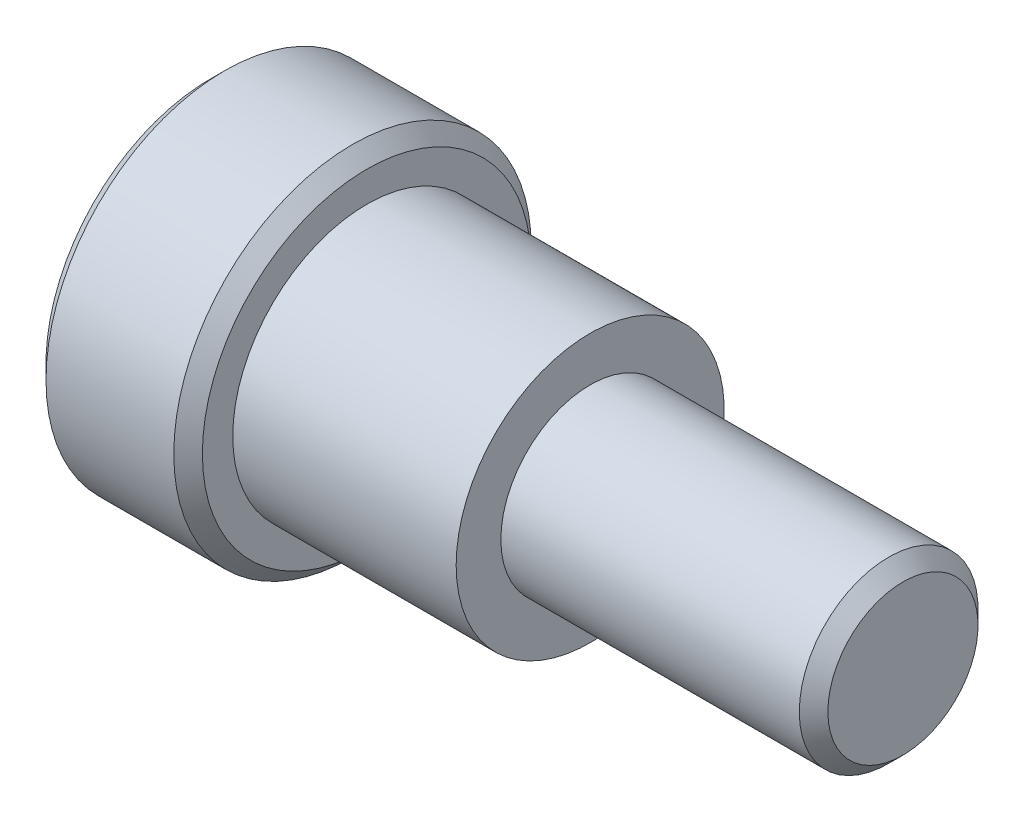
ISO-10303-21;
HEADER;
FILE_DESCRIPTION(('STEP AP214'),'2;1');
FILE_NAME('part.step','',(''),(''),'','','');
FILE_SCHEMA(('AUTOMOTIVE_DESIGN { 1 0 10303 214 1 1 1 1 }'));
ENDSEC;
DATA;
#1=APPLICATION_CONTEXT('core data for automotive mechanical design processes');
#2=APPLICATION_PROTOCOL_DEFINITION('international standard','automotive_design',2000,#1);
#3=PRODUCT_CONTEXT('',#1,'mechanical');
#4=PRODUCT('Part','Part','',(#3));
#5=PRODUCT_RELATED_PRODUCT_CATEGORY('part','',(#4));
#6=PRODUCT_DEFINITION_FORMATION('','',#4);
#7=PRODUCT_DEFINITION_CONTEXT('part definition',#1,'design');
#8=PRODUCT_DEFINITION('design','',#6,#7);
#9=PRODUCT_DEFINITION_SHAPE('','',#8);
#10=(LENGTH_UNIT() NAMED_UNIT(*) SI_UNIT(.MILLI.,.METRE.));
#11=(NAMED_UNIT(*) PLANE_ANGLE_UNIT() SI_UNIT($,.RADIAN.));
#12=(NAMED_UNIT(*) SI_UNIT($,.STERADIAN.) SOLID_ANGLE_UNIT());
#13=UNCERTAINTY_MEASURE_WITH_UNIT(LENGTH_MEASURE(1.E-05),#10,'distance_accuracy_value','');
#14=(GEOMETRIC_REPRESENTATION_CONTEXT(3) GLOBAL_UNCERTAINTY_ASSIGNED_CONTEXT((#13)) GLOBAL_UNIT_ASSIGNED_CONTEXT((#10,
#11,#12)) REPRESENTATION_CONTEXT('',''));
#15=CARTESIAN_POINT('',(0.,0.,0.));
#16=DIRECTION('',(0.,0.,1.));
#17=DIRECTION('',(1.,0.,0.));
#18=AXIS2_PLACEMENT_3D('',#15,#16,#17);
#19=CARTESIAN_POINT('',(0.,6.35,0.));
#20=DIRECTION('',(1.,0.,0.));
#21=DIRECTION('',(0.,0.,-1.));
#22=AXIS2_PLACEMENT_3D('',#19,#20,#21);
#23=PLANE('',#22);
#24=DIRECTION('',(0.,-0.866025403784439,0.499999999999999));
#25=VECTOR('',#24,1.);
#26=CARTESIAN_POINT('',(0.,-1.984375,-1.14567944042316));
#27=LINE('',#26,#25);
#28=CARTESIAN_POINT('',(0.,0.,-2.29135888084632));
#29=VERTEX_POINT('',#28);
#30=CARTESIAN_POINT('',(0.,-1.984375,-1.14567944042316));
#31=VERTEX_POINT('',#30);
#32=EDGE_CURVE('E124',#29,#31,#27,.T.);
#33=ORIENTED_EDGE('',*,*,#32,.F.);
#34=DIRECTION('',(0.,-0.86602540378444,-0.499999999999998));
#35=VECTOR('',#34,1.);
#36=CARTESIAN_POINT('',(0.,0.,-2.29135888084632));
#37=LINE('',#36,#35);
#38=CARTESIAN_POINT('',(0.,1.984375,-1.14567944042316));
#39=VERTEX_POINT('',#38);
#40=EDGE_CURVE('E50',#39,#29,#37,.T.);
#41=ORIENTED_EDGE('',*,*,#40,.F.);
#42=DIRECTION('',(0.,0.,-1.));
#43=VECTOR('',#42,1.);
#44=CARTESIAN_POINT('',(0.,1.984375,-1.14567944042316));
#45=LINE('',#44,#43);
#46=CARTESIAN_POINT('',(0.,1.984375,1.14567944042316));
#47=VERTEX_POINT('',#46);
#48=EDGE_CURVE('E133',#47,#39,#45,.T.);
#49=ORIENTED_EDGE('',*,*,#48,.F.);
#50=DIRECTION('',(0.,0.866025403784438,-0.500000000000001));
#51=VECTOR('',#50,1.);
#52=CARTESIAN_POINT('',(0.,1.984375,1.14567944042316));
#53=LINE('',#52,#51);
#54=CARTESIAN_POINT('',(0.,0.,2.29135888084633));
#55=VERTEX_POINT('',#54);
#56=EDGE_CURVE('E131',#55,#47,#53,.T.);
#57=ORIENTED_EDGE('',*,*,#56,.F.);
#58=DIRECTION('',(0.,0.866025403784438,0.500000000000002));
#59=VECTOR('',#58,1.);
#60=CARTESIAN_POINT('',(0.,0.,2.29135888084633));
#61=LINE('',#60,#59);
#62=CARTESIAN_POINT('',(0.,-1.984375,1.14567944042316));
#63=VERTEX_POINT('',#62);
#64=EDGE_CURVE('E98',#63,#55,#61,.T.);
#65=ORIENTED_EDGE('',*,*,#64,.F.);
#66=DIRECTION('',(0.,0.,1.));
#67=VECTOR('',#66,1.);
#68=CARTESIAN_POINT('',(0.,-1.984375,1.14567944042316));
#69=LINE('',#68,#67);
#70=EDGE_CURVE('E127',#31,#63,#69,.T.);
#71=ORIENTED_EDGE('',*,*,#70,.F.);
#72=EDGE_LOOP('',(#33,#41,#49,#57,#65,#71));
#73=FACE_BOUND('',#72,.T.);
#74=CARTESIAN_POINT('',(0.,0.,0.));
#75=DIRECTION('',(1.,0.,0.));
#76=DIRECTION('',(0.,0.,-1.));
#77=AXIS2_PLACEMENT_3D('',#74,#75,#76);
#78=CIRCLE('',#77,5.84199999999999);
#79=CARTESIAN_POINT('',(0.,0.,-5.84199999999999));
#80=VERTEX_POINT('',#79);
#81=EDGE_CURVE('E11',#80,#80,#78,.F.);
#82=ORIENTED_EDGE('',*,*,#81,.T.);
#83=EDGE_LOOP('',(#82));
#84=FACE_BOUND('',#83,.T.);
#85=ADVANCED_FACE('F35',(#73,#84),#23,.F.);
#86=CARTESIAN_POINT('',(0.,0.,0.));
#87=DIRECTION('',(-1.,0.,0.));
#88=DIRECTION('',(0.,0.,1.));
#89=AXIS2_PLACEMENT_3D('',#86,#87,#88);
#90=CYLINDRICAL_SURFACE('',#89,6.35);
#91=CARTESIAN_POINT('',(5.04825,0.,0.));
#92=DIRECTION('',(-1.,0.,0.));
#93=DIRECTION('',(0.,0.,1.));
#94=AXIS2_PLACEMENT_3D('',#91,#92,#93);
#95=CIRCLE('',#94,6.35);
#96=CARTESIAN_POINT('',(5.04825,0.,6.35));
#97=VERTEX_POINT('',#96);
#98=EDGE_CURVE('E160',#97,#97,#95,.T.);
#99=ORIENTED_EDGE('',*,*,#98,.T.);
#100=EDGE_LOOP('',(#99));
#101=FACE_BOUND('',#100,.T.);
#102=CARTESIAN_POINT('',(0.508000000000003,0.,0.));
#103=DIRECTION('',(1.,0.,0.));
#104=DIRECTION('',(0.,0.,-1.));
#105=AXIS2_PLACEMENT_3D('',#102,#103,#104);
#106=CIRCLE('',#105,6.35);
#107=CARTESIAN_POINT('',(0.508000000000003,0.,-6.35));
#108=VERTEX_POINT('',#107);
#109=EDGE_CURVE('E157',#108,#108,#106,.T.);
#110=ORIENTED_EDGE('',*,*,#109,.T.);
#111=EDGE_LOOP('',(#110));
#112=FACE_BOUND('',#111,.T.);
#113=ADVANCED_FACE('F174',(#101,#112),#90,.T.);
#114=CARTESIAN_POINT('',(5.55625,6.35,0.));
#115=DIRECTION('',(-1.,0.,0.));
#116=DIRECTION('',(0.,0.,1.));
#117=AXIS2_PLACEMENT_3D('',#114,#115,#116);
#118=PLANE('',#117);
#119=CARTESIAN_POINT('',(5.55625,0.,0.));
#120=DIRECTION('',(-1.,0.,0.));
#121=DIRECTION('',(0.,0.,1.));
#122=AXIS2_PLACEMENT_3D('',#119,#120,#121);
#123=CIRCLE('',#122,5.84199999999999);
#124=CARTESIAN_POINT('',(5.55625,0.,5.84199999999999));
#125=VERTEX_POINT('',#124);
#126=EDGE_CURVE('E43',#125,#125,#123,.F.);
#127=ORIENTED_EDGE('',*,*,#126,.T.);
#128=EDGE_LOOP('',(#127));
#129=FACE_BOUND('',#128,.T.);
#130=CARTESIAN_POINT('',(5.55625,0.,0.));
#131=DIRECTION('',(-1.,0.,0.));
#132=DIRECTION('',(0.,0.,1.));
#133=AXIS2_PLACEMENT_3D('',#130,#131,#132);
#134=CIRCLE('',#133,4.7625);
#135=CARTESIAN_POINT('',(5.55625,0.,4.7625));
#136=VERTEX_POINT('',#135);
#137=EDGE_CURVE('E148',#136,#136,#134,.T.);
#138=ORIENTED_EDGE('',*,*,#137,.T.);
#139=EDGE_LOOP('',(#138));
#140=FACE_BOUND('',#139,.T.);
#141=ADVANCED_FACE('F165',(#129,#140),#118,.F.);
#142=CARTESIAN_POINT('',(0.,0.,0.));
#143=DIRECTION('',(-1.,0.,0.));
#144=DIRECTION('',(0.,0.,1.));
#145=AXIS2_PLACEMENT_3D('',#142,#143,#144);
#146=CYLINDRICAL_SURFACE('',#145,4.7625);
#147=ORIENTED_EDGE('',*,*,#137,.F.);
#148=EDGE_LOOP('',(#147));
#149=FACE_BOUND('',#148,.T.);
#150=CARTESIAN_POINT('',(13.49375,0.,0.));
#151=DIRECTION('',(-1.,0.,0.));
#152=DIRECTION('',(0.,0.,1.));
#153=AXIS2_PLACEMENT_3D('',#150,#151,#152);
#154=CIRCLE('',#153,4.7625);
#155=CARTESIAN_POINT('',(13.49375,0.,4.7625));
#156=VERTEX_POINT('',#155);
#157=EDGE_CURVE('E145',#156,#156,#154,.T.);
#158=ORIENTED_EDGE('',*,*,#157,.T.);
#159=EDGE_LOOP('',(#158));
#160=FACE_BOUND('',#159,.T.);
#161=ADVANCED_FACE('F213',(#149,#160),#146,.T.);
#162=CARTESIAN_POINT('',(13.49375,4.7625,0.));
#163=DIRECTION('',(-1.,0.,0.));
#164=DIRECTION('',(0.,0.,1.));
#165=AXIS2_PLACEMENT_3D('',#162,#163,#164);
#166=PLANE('',#165);
#167=ORIENTED_EDGE('',*,*,#157,.F.);
#168=EDGE_LOOP('',(#167));
#169=FACE_BOUND('',#168,.T.);
#170=CARTESIAN_POINT('',(13.49375,0.,0.));
#171=DIRECTION('',(-1.,0.,0.));
#172=DIRECTION('',(0.,0.,1.));
#173=AXIS2_PLACEMENT_3D('',#170,#171,#172);
#174=CIRCLE('',#173,3.175);
#175=CARTESIAN_POINT('',(13.49375,0.,3.175));
#176=VERTEX_POINT('',#175);
#177=EDGE_CURVE('E137',#176,#176,#174,.T.);
#178=ORIENTED_EDGE('',*,*,#177,.T.);
#179=EDGE_LOOP('',(#178));
#180=FACE_BOUND('',#179,.T.);
#181=ADVANCED_FACE('F208',(#169,#180),#166,.F.);
#182=CARTESIAN_POINT('',(0.,0.,0.));
#183=DIRECTION('',(-1.,0.,0.));
#184=DIRECTION('',(0.,0.,1.));
#185=AXIS2_PLACEMENT_3D('',#182,#183,#184);
#186=CYLINDRICAL_SURFACE('',#185,3.175);
#187=CARTESIAN_POINT('',(24.09825,0.,0.));
#188=DIRECTION('',(-1.,0.,0.));
#189=DIRECTION('',(0.,0.,1.));
#190=AXIS2_PLACEMENT_3D('',#187,#188,#189);
#191=CIRCLE('',#190,3.175);
#192=CARTESIAN_POINT('',(24.09825,0.,3.175));
#193=VERTEX_POINT('',#192);
#194=EDGE_CURVE('E151',#193,#193,#191,.T.);
#195=ORIENTED_EDGE('',*,*,#194,.T.);
#196=EDGE_LOOP('',(#195));
#197=FACE_BOUND('',#196,.T.);
#198=ORIENTED_EDGE('',*,*,#177,.F.);
#199=EDGE_LOOP('',(#198));
#200=FACE_BOUND('',#199,.T.);
#201=ADVANCED_FACE('F199',(#197,#200),#186,.T.);
#202=CARTESIAN_POINT('',(24.60625,3.175,0.));
#203=DIRECTION('',(-1.,0.,0.));
#204=DIRECTION('',(0.,0.,1.));
#205=AXIS2_PLACEMENT_3D('',#202,#203,#204);
#206=PLANE('',#205);
#207=CARTESIAN_POINT('',(24.60625,0.,0.));
#208=DIRECTION('',(-1.,0.,0.));
#209=DIRECTION('',(0.,0.,1.));
#210=AXIS2_PLACEMENT_3D('',#207,#208,#209);
#211=CIRCLE('',#210,2.667);
#212=CARTESIAN_POINT('',(24.60625,0.,2.667));
#213=VERTEX_POINT('',#212);
#214=EDGE_CURVE('E154',#213,#213,#211,.F.);
#215=ORIENTED_EDGE('',*,*,#214,.T.);
#216=EDGE_LOOP('',(#215));
#217=FACE_BOUND('',#216,.T.);
#218=ADVANCED_FACE('F194',(#217),#206,.F.);
#219=CARTESIAN_POINT('',(24.09825,0.,0.));
#220=DIRECTION('',(-1.,0.,0.));
#221=DIRECTION('',(0.,0.,1.));
#222=AXIS2_PLACEMENT_3D('',#219,#220,#221);
#223=CONICAL_SURFACE('',#222,3.175,0.785398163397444);
#224=ORIENTED_EDGE('',*,*,#214,.F.);
#225=EDGE_LOOP('',(#224));
#226=FACE_BOUND('',#225,.T.);
#227=ORIENTED_EDGE('',*,*,#194,.F.);
#228=EDGE_LOOP('',(#227));
#229=FACE_BOUND('',#228,.T.);
#230=ADVANCED_FACE('F171',(#226,#229),#223,.T.);
#231=CARTESIAN_POINT('',(5.04825,0.,0.));
#232=DIRECTION('',(-1.,0.,0.));
#233=DIRECTION('',(0.,0.,1.));
#234=AXIS2_PLACEMENT_3D('',#231,#232,#233);
#235=CONICAL_SURFACE('',#234,6.35,0.785398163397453);
#236=ORIENTED_EDGE('',*,*,#126,.F.);
#237=EDGE_LOOP('',(#236));
#238=FACE_BOUND('',#237,.T.);
#239=ORIENTED_EDGE('',*,*,#98,.F.);
#240=EDGE_LOOP('',(#239));
#241=FACE_BOUND('',#240,.T.);
#242=ADVANCED_FACE('F168',(#238,#241),#235,.T.);
#243=CARTESIAN_POINT('',(0.,0.,0.));
#244=DIRECTION('',(1.,0.,0.));
#245=DIRECTION('',(0.,0.,-1.));
#246=AXIS2_PLACEMENT_3D('',#243,#244,#245);
#247=CONICAL_SURFACE('',#246,5.84199999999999,0.785398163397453);
#248=ORIENTED_EDGE('',*,*,#109,.F.);
#249=EDGE_LOOP('',(#248));
#250=FACE_BOUND('',#249,.T.);
#251=ORIENTED_EDGE('',*,*,#81,.F.);
#252=EDGE_LOOP('',(#251));
#253=FACE_BOUND('',#252,.T.);
#254=ADVANCED_FACE('F37',(#250,#253),#247,.T.);
#255=CARTESIAN_POINT('',(4.7752,0.,-2.29135888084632));
#256=DIRECTION('',(0.,0.499999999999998,-0.86602540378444));
#257=DIRECTION('',(0.,0.86602540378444,0.499999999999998));
#258=AXIS2_PLACEMENT_3D('',#255,#256,#257);
#259=PLANE('',#258);
#260=ORIENTED_EDGE('',*,*,#40,.T.);
#261=DIRECTION('',(-1.,0.,0.));
#262=VECTOR('',#261,1.);
#263=CARTESIAN_POINT('',(4.7752,0.,-2.29135888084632));
#264=LINE('',#263,#262);
#265=CARTESIAN_POINT('',(4.7752,0.,-2.29135888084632));
#266=VERTEX_POINT('',#265);
#267=EDGE_CURVE('E80',#266,#29,#264,.T.);
#268=ORIENTED_EDGE('',*,*,#267,.F.);
#269=DIRECTION('',(0.,-0.86602540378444,-0.499999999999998));
#270=VECTOR('',#269,1.);
#271=CARTESIAN_POINT('',(4.7752,0.,-2.29135888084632));
#272=LINE('',#271,#270);
#273=CARTESIAN_POINT('',(4.7752,1.984375,-1.14567944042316));
#274=VERTEX_POINT('',#273);
#275=EDGE_CURVE('E135',#274,#266,#272,.T.);
#276=ORIENTED_EDGE('',*,*,#275,.F.);
#277=DIRECTION('',(-1.,0.,0.));
#278=VECTOR('',#277,1.);
#279=CARTESIAN_POINT('',(4.7752,1.984375,-1.14567944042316));
#280=LINE('',#279,#278);
#281=EDGE_CURVE('E58',#274,#39,#280,.T.);
#282=ORIENTED_EDGE('',*,*,#281,.T.);
#283=EDGE_LOOP('',(#260,#268,#276,#282));
#284=FACE_BOUND('',#283,.T.);
#285=ADVANCED_FACE('F182',(#284),#259,.F.);
#286=CARTESIAN_POINT('',(4.7752,1.984375,-1.14567944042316));
#287=DIRECTION('',(0.,1.,0.));
#288=DIRECTION('',(0.,0.,1.));
#289=AXIS2_PLACEMENT_3D('',#286,#287,#288);
#290=PLANE('',#289);
#291=ORIENTED_EDGE('',*,*,#48,.T.);
#292=ORIENTED_EDGE('',*,*,#281,.F.);
#293=DIRECTION('',(0.,0.,-1.));
#294=VECTOR('',#293,1.);
#295=CARTESIAN_POINT('',(4.7752,1.984375,-1.14567944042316));
#296=LINE('',#295,#294);
#297=CARTESIAN_POINT('',(4.7752,1.984375,1.14567944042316));
#298=VERTEX_POINT('',#297);
#299=EDGE_CURVE('E110',#298,#274,#296,.T.);
#300=ORIENTED_EDGE('',*,*,#299,.F.);
#301=DIRECTION('',(-1.,0.,0.));
#302=VECTOR('',#301,1.);
#303=CARTESIAN_POINT('',(4.7752,1.984375,1.14567944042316));
#304=LINE('',#303,#302);
#305=EDGE_CURVE('E102',#298,#47,#304,.T.);
#306=ORIENTED_EDGE('',*,*,#305,.T.);
#307=EDGE_LOOP('',(#291,#292,#300,#306));
#308=FACE_BOUND('',#307,.T.);
#309=ADVANCED_FACE('F260',(#308),#290,.F.);
#310=CARTESIAN_POINT('',(4.7752,1.984375,1.14567944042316));
#311=DIRECTION('',(0.,0.500000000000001,0.866025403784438));
#312=DIRECTION('',(0.,-0.866025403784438,0.500000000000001));
#313=AXIS2_PLACEMENT_3D('',#310,#311,#312);
#314=PLANE('',#313);
#315=ORIENTED_EDGE('',*,*,#56,.T.);
#316=ORIENTED_EDGE('',*,*,#305,.F.);
#317=DIRECTION('',(0.,0.866025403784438,-0.500000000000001));
#318=VECTOR('',#317,1.);
#319=CARTESIAN_POINT('',(4.7752,1.984375,1.14567944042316));
#320=LINE('',#319,#318);
#321=CARTESIAN_POINT('',(4.7752,0.,2.29135888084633));
#322=VERTEX_POINT('',#321);
#323=EDGE_CURVE('E106',#322,#298,#320,.T.);
#324=ORIENTED_EDGE('',*,*,#323,.F.);
#325=DIRECTION('',(-1.,0.,0.));
#326=VECTOR('',#325,1.);
#327=CARTESIAN_POINT('',(4.7752,0.,2.29135888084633));
#328=LINE('',#327,#326);
#329=EDGE_CURVE('E91',#322,#55,#328,.T.);
#330=ORIENTED_EDGE('',*,*,#329,.T.);
#331=EDGE_LOOP('',(#315,#316,#324,#330));
#332=FACE_BOUND('',#331,.T.);
#333=ADVANCED_FACE('F107',(#332),#314,.F.);
#334=CARTESIAN_POINT('',(4.7752,0.,2.29135888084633));
#335=DIRECTION('',(0.,-0.500000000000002,0.866025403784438));
#336=DIRECTION('',(0.,-0.866025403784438,-0.500000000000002));
#337=AXIS2_PLACEMENT_3D('',#334,#335,#336);
#338=PLANE('',#337);
#339=ORIENTED_EDGE('',*,*,#64,.T.);
#340=ORIENTED_EDGE('',*,*,#329,.F.);
#341=DIRECTION('',(0.,0.866025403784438,0.500000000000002));
#342=VECTOR('',#341,1.);
#343=CARTESIAN_POINT('',(4.7752,0.,2.29135888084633));
#344=LINE('',#343,#342);
#345=CARTESIAN_POINT('',(4.7752,-1.984375,1.14567944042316));
#346=VERTEX_POINT('',#345);
#347=EDGE_CURVE('E95',#346,#322,#344,.T.);
#348=ORIENTED_EDGE('',*,*,#347,.F.);
#349=DIRECTION('',(-1.,0.,0.));
#350=VECTOR('',#349,1.);
#351=CARTESIAN_POINT('',(4.7752,-1.984375,1.14567944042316));
#352=LINE('',#351,#350);
#353=EDGE_CURVE('E103',#346,#63,#352,.T.);
#354=ORIENTED_EDGE('',*,*,#353,.T.);
#355=EDGE_LOOP('',(#339,#340,#348,#354));
#356=FACE_BOUND('',#355,.T.);
#357=ADVANCED_FACE('F93',(#356),#338,.F.);
#358=CARTESIAN_POINT('',(4.7752,-1.984375,1.14567944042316));
#359=DIRECTION('',(0.,-1.,0.));
#360=DIRECTION('',(0.,0.,-1.));
#361=AXIS2_PLACEMENT_3D('',#358,#359,#360);
#362=PLANE('',#361);
#363=ORIENTED_EDGE('',*,*,#70,.T.);
#364=ORIENTED_EDGE('',*,*,#353,.F.);
#365=DIRECTION('',(0.,0.,1.));
#366=VECTOR('',#365,1.);
#367=CARTESIAN_POINT('',(4.7752,-1.984375,1.14567944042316));
#368=LINE('',#367,#366);
#369=CARTESIAN_POINT('',(4.7752,-1.984375,-1.14567944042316));
#370=VERTEX_POINT('',#369);
#371=EDGE_CURVE('E116',#370,#346,#368,.T.);
#372=ORIENTED_EDGE('',*,*,#371,.F.);
#373=DIRECTION('',(-1.,0.,0.));
#374=VECTOR('',#373,1.);
#375=CARTESIAN_POINT('',(4.7752,-1.984375,-1.14567944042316));
#376=LINE('',#375,#374);
#377=EDGE_CURVE('E140',#370,#31,#376,.T.);
#378=ORIENTED_EDGE('',*,*,#377,.T.);
#379=EDGE_LOOP('',(#363,#364,#372,#378));
#380=FACE_BOUND('',#379,.T.);
#381=ADVANCED_FACE('F285',(#380),#362,.F.);
#382=CARTESIAN_POINT('',(4.7752,-1.984375,-1.14567944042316));
#383=DIRECTION('',(0.,-0.499999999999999,-0.866025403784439));
#384=DIRECTION('',(0.,0.866025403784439,-0.499999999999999));
#385=AXIS2_PLACEMENT_3D('',#382,#383,#384);
#386=PLANE('',#385);
#387=ORIENTED_EDGE('',*,*,#32,.T.);
#388=ORIENTED_EDGE('',*,*,#377,.F.);
#389=DIRECTION('',(0.,-0.866025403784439,0.499999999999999));
#390=VECTOR('',#389,1.);
#391=CARTESIAN_POINT('',(4.7752,-1.984375,-1.14567944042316));
#392=LINE('',#391,#390);
#393=EDGE_CURVE('E118',#266,#370,#392,.T.);
#394=ORIENTED_EDGE('',*,*,#393,.F.);
#395=ORIENTED_EDGE('',*,*,#267,.T.);
#396=EDGE_LOOP('',(#387,#388,#394,#395));
#397=FACE_BOUND('',#396,.T.);
#398=ADVANCED_FACE('F294',(#397),#386,.F.);
#399=CARTESIAN_POINT('',(4.7752,1.984375,-1.14567944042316));
#400=DIRECTION('',(1.,0.,0.));
#401=DIRECTION('',(0.,0.,-1.));
#402=AXIS2_PLACEMENT_3D('',#399,#400,#401);
#403=PLANE('',#402);
#404=ORIENTED_EDGE('',*,*,#275,.T.);
#405=ORIENTED_EDGE('',*,*,#393,.T.);
#406=ORIENTED_EDGE('',*,*,#371,.T.);
#407=ORIENTED_EDGE('',*,*,#347,.T.);
#408=ORIENTED_EDGE('',*,*,#323,.T.);
#409=ORIENTED_EDGE('',*,*,#299,.T.);
#410=EDGE_LOOP('',(#404,#405,#406,#407,#408,#409));
#411=FACE_BOUND('',#410,.T.);
#412=ADVANCED_FACE('F113',(#411),#403,.F.);
#413=CLOSED_SHELL('',(#85,#113,#141,#161,#181,#201,#218,#230,#242,#254,#285,#309,#333,#357,#381,
#398,#412));
#414=MANIFOLD_SOLID_BREP('B2',#413);
#415=ADVANCED_BREP_SHAPE_REPRESENTATION('',(#18,#414),#14);
#416=SHAPE_DEFINITION_REPRESENTATION(#9,#415);
ENDSEC;
END-ISO-10303-21;
